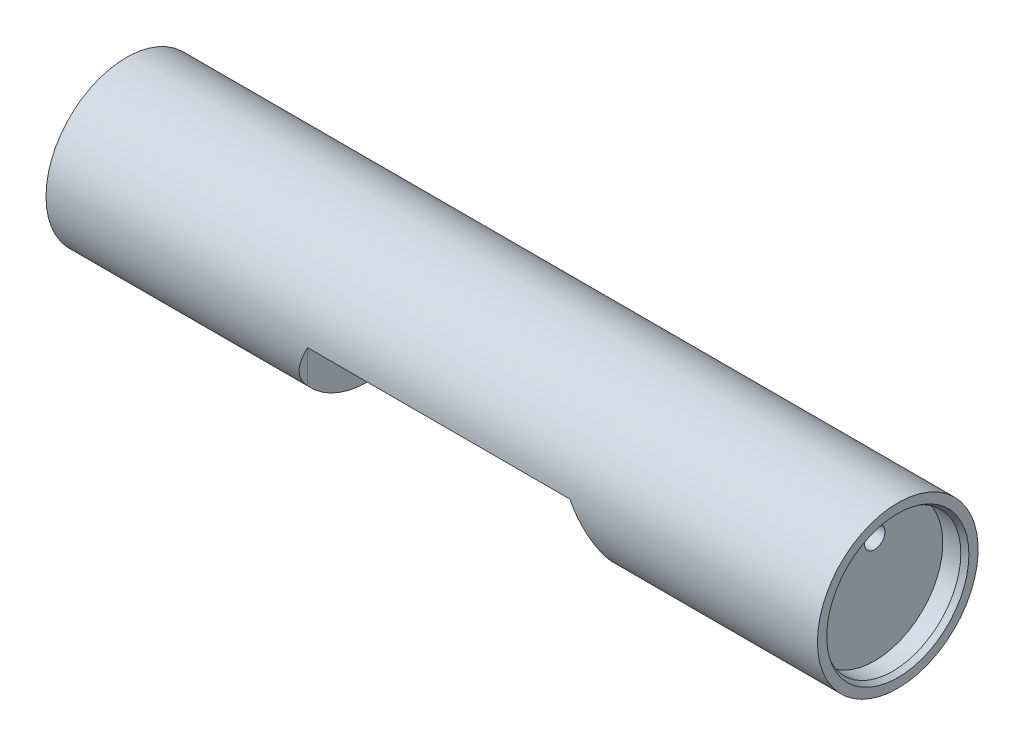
ISO-10303-21;
HEADER;
FILE_DESCRIPTION(('STEP AP214'),'2;1');
FILE_NAME('part.step','',(''),(''),'','','');
FILE_SCHEMA(('AUTOMOTIVE_DESIGN { 1 0 10303 214 1 1 1 1 }'));
ENDSEC;
DATA;
#1=APPLICATION_CONTEXT('core data for automotive mechanical design processes');
#2=APPLICATION_PROTOCOL_DEFINITION('international standard','automotive_design',2000,#1);
#3=PRODUCT_CONTEXT('',#1,'mechanical');
#4=PRODUCT('Part','Part','',(#3));
#5=PRODUCT_RELATED_PRODUCT_CATEGORY('part','',(#4));
#6=PRODUCT_DEFINITION_FORMATION('','',#4);
#7=PRODUCT_DEFINITION_CONTEXT('part definition',#1,'design');
#8=PRODUCT_DEFINITION('design','',#6,#7);
#9=PRODUCT_DEFINITION_SHAPE('','',#8);
#10=(LENGTH_UNIT() NAMED_UNIT(*) SI_UNIT(.MILLI.,.METRE.));
#11=(NAMED_UNIT(*) PLANE_ANGLE_UNIT() SI_UNIT($,.RADIAN.));
#12=(NAMED_UNIT(*) SI_UNIT($,.STERADIAN.) SOLID_ANGLE_UNIT());
#13=UNCERTAINTY_MEASURE_WITH_UNIT(LENGTH_MEASURE(1.E-05),#10,'distance_accuracy_value','');
#14=(GEOMETRIC_REPRESENTATION_CONTEXT(3) GLOBAL_UNCERTAINTY_ASSIGNED_CONTEXT((#13)) GLOBAL_UNIT_ASSIGNED_CONTEXT((#10,
#11,#12)) REPRESENTATION_CONTEXT('',''));
#15=CARTESIAN_POINT('',(0.,0.,0.));
#16=DIRECTION('',(0.,0.,1.));
#17=DIRECTION('',(1.,0.,0.));
#18=AXIS2_PLACEMENT_3D('',#15,#16,#17);
#19=CARTESIAN_POINT('',(46.85,0.,-20.));
#20=DIRECTION('',(0.,1.,0.));
#21=DIRECTION('',(0.,0.,1.));
#22=AXIS2_PLACEMENT_3D('',#19,#20,#21);
#23=PLANE('',#22);
#24=CARTESIAN_POINT('',(62.35,0.,0.));
#25=DIRECTION('',(0.,-1.,0.));
#26=DIRECTION('',(0.,0.,-1.));
#27=AXIS2_PLACEMENT_3D('',#24,#25,#26);
#28=CIRCLE('',#27,1.65);
#29=CARTESIAN_POINT('',(62.35,0.,-1.65));
#30=VERTEX_POINT('',#29);
#31=EDGE_CURVE('E186',#30,#30,#28,.T.);
#32=ORIENTED_EDGE('',*,*,#31,.F.);
#33=EDGE_LOOP('',(#32));
#34=FACE_BOUND('',#33,.T.);
#35=CARTESIAN_POINT('',(90.35,0.,0.));
#36=DIRECTION('',(0.,-1.,0.));
#37=DIRECTION('',(0.,0.,-1.));
#38=AXIS2_PLACEMENT_3D('',#35,#36,#37);
#39=CIRCLE('',#38,1.65);
#40=CARTESIAN_POINT('',(90.35,0.,-1.65));
#41=VERTEX_POINT('',#40);
#42=EDGE_CURVE('E192',#41,#41,#39,.T.);
#43=ORIENTED_EDGE('',*,*,#42,.F.);
#44=EDGE_LOOP('',(#43));
#45=FACE_BOUND('',#44,.T.);
#46=CARTESIAN_POINT('',(101.85,0.,-11.625));
#47=DIRECTION('',(0.,1.,0.));
#48=DIRECTION('',(0.,0.,-1.));
#49=AXIS2_PLACEMENT_3D('',#46,#47,#48);
#50=CIRCLE('',#49,4.);
#51=CARTESIAN_POINT('',(105.85,0.,-11.625));
#52=VERTEX_POINT('',#51);
#53=CARTESIAN_POINT('',(101.85,0.,-15.625));
#54=VERTEX_POINT('',#53);
#55=EDGE_CURVE('E109',#52,#54,#50,.T.);
#56=ORIENTED_EDGE('',*,*,#55,.F.);
#57=DIRECTION('',(0.,0.,1.));
#58=VECTOR('',#57,1.);
#59=CARTESIAN_POINT('',(105.85,0.,-20.));
#60=LINE('',#59,#58);
#61=CARTESIAN_POINT('',(105.85,0.,11.625));
#62=VERTEX_POINT('',#61);
#63=EDGE_CURVE('E100',#52,#62,#60,.T.);
#64=ORIENTED_EDGE('',*,*,#63,.T.);
#65=CARTESIAN_POINT('',(101.85,0.,11.625));
#66=DIRECTION('',(0.,1.,0.));
#67=DIRECTION('',(0.,0.,-1.));
#68=AXIS2_PLACEMENT_3D('',#65,#66,#67);
#69=CIRCLE('',#68,4.);
#70=CARTESIAN_POINT('',(101.85,0.,15.625));
#71=VERTEX_POINT('',#70);
#72=EDGE_CURVE('E165',#71,#62,#69,.T.);
#73=ORIENTED_EDGE('',*,*,#72,.F.);
#74=DIRECTION('',(-1.,0.,0.));
#75=VECTOR('',#74,1.);
#76=CARTESIAN_POINT('',(0.,0.,15.625));
#77=LINE('',#76,#75);
#78=CARTESIAN_POINT('',(50.85,0.,15.625));
#79=VERTEX_POINT('',#78);
#80=EDGE_CURVE('E212',#71,#79,#77,.T.);
#81=ORIENTED_EDGE('',*,*,#80,.T.);
#82=CARTESIAN_POINT('',(50.85,0.,11.625));
#83=DIRECTION('',(0.,1.,0.));
#84=DIRECTION('',(0.,0.,-1.));
#85=AXIS2_PLACEMENT_3D('',#82,#83,#84);
#86=CIRCLE('',#85,4.);
#87=CARTESIAN_POINT('',(46.85,0.,11.625));
#88=VERTEX_POINT('',#87);
#89=EDGE_CURVE('E162',#88,#79,#86,.T.);
#90=ORIENTED_EDGE('',*,*,#89,.F.);
#91=DIRECTION('',(0.,0.,1.));
#92=VECTOR('',#91,1.);
#93=CARTESIAN_POINT('',(46.85,0.,-20.));
#94=LINE('',#93,#92);
#95=CARTESIAN_POINT('',(46.85,0.,-11.625));
#96=VERTEX_POINT('',#95);
#97=EDGE_CURVE('E106',#96,#88,#94,.T.);
#98=ORIENTED_EDGE('',*,*,#97,.F.);
#99=CARTESIAN_POINT('',(50.85,0.,-11.625));
#100=DIRECTION('',(0.,1.,0.));
#101=DIRECTION('',(0.,0.,-1.));
#102=AXIS2_PLACEMENT_3D('',#99,#100,#101);
#103=CIRCLE('',#102,4.);
#104=CARTESIAN_POINT('',(50.85,0.,-15.625));
#105=VERTEX_POINT('',#104);
#106=EDGE_CURVE('E125',#105,#96,#103,.T.);
#107=ORIENTED_EDGE('',*,*,#106,.F.);
#108=DIRECTION('',(-1.,0.,0.));
#109=VECTOR('',#108,1.);
#110=CARTESIAN_POINT('',(0.,0.,-15.625));
#111=LINE('',#110,#109);
#112=EDGE_CURVE('E51',#105,#54,#111,.F.);
#113=ORIENTED_EDGE('',*,*,#112,.T.);
#114=EDGE_LOOP('',(#56,#64,#73,#81,#90,#98,#107,#113));
#115=FACE_BOUND('',#114,.T.);
#116=ADVANCED_FACE('F36',(#34,#45,#115),#23,.F.);
#117=CARTESIAN_POINT('',(105.85,0.,-20.));
#118=DIRECTION('',(1.,0.,0.));
#119=DIRECTION('',(0.,0.,-1.));
#120=AXIS2_PLACEMENT_3D('',#117,#118,#119);
#121=PLANE('',#120);
#122=DIRECTION('',(0.,1.,0.));
#123=VECTOR('',#122,1.);
#124=CARTESIAN_POINT('',(105.85,-15.626,-11.625));
#125=LINE('',#124,#123);
#126=CARTESIAN_POINT('',(105.85,-10.4403065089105,-11.625));
#127=VERTEX_POINT('',#126);
#128=EDGE_CURVE('E59',#127,#52,#125,.T.);
#129=ORIENTED_EDGE('',*,*,#128,.F.);
#130=CARTESIAN_POINT('',(105.85,0.,0.));
#131=DIRECTION('',(1.,0.,0.));
#132=DIRECTION('',(0.,0.,-1.));
#133=AXIS2_PLACEMENT_3D('',#130,#131,#132);
#134=CIRCLE('',#133,15.625);
#135=CARTESIAN_POINT('',(105.85,-10.4403065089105,11.625));
#136=VERTEX_POINT('',#135);
#137=EDGE_CURVE('E210',#127,#136,#134,.F.);
#138=ORIENTED_EDGE('',*,*,#137,.T.);
#139=DIRECTION('',(0.,1.,0.));
#140=VECTOR('',#139,1.);
#141=CARTESIAN_POINT('',(105.85,-15.626,11.625));
#142=LINE('',#141,#140);
#143=EDGE_CURVE('E103',#136,#62,#142,.T.);
#144=ORIENTED_EDGE('',*,*,#143,.T.);
#145=ORIENTED_EDGE('',*,*,#63,.F.);
#146=EDGE_LOOP('',(#129,#138,#144,#145));
#147=FACE_BOUND('',#146,.T.);
#148=ADVANCED_FACE('F101',(#147),#121,.F.);
#149=CARTESIAN_POINT('',(46.85,0.,-20.));
#150=DIRECTION('',(-1.,0.,0.));
#151=DIRECTION('',(0.,0.,1.));
#152=AXIS2_PLACEMENT_3D('',#149,#150,#151);
#153=PLANE('',#152);
#154=CARTESIAN_POINT('',(46.85,0.,0.));
#155=DIRECTION('',(-1.,0.,0.));
#156=DIRECTION('',(0.,0.,1.));
#157=AXIS2_PLACEMENT_3D('',#154,#155,#156);
#158=CIRCLE('',#157,15.625);
#159=CARTESIAN_POINT('',(46.85,-10.4403065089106,11.625));
#160=VERTEX_POINT('',#159);
#161=CARTESIAN_POINT('',(46.85,-10.4403065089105,-11.625));
#162=VERTEX_POINT('',#161);
#163=EDGE_CURVE('E215',#160,#162,#158,.F.);
#164=ORIENTED_EDGE('',*,*,#163,.T.);
#165=DIRECTION('',(0.,1.,0.));
#166=VECTOR('',#165,1.);
#167=CARTESIAN_POINT('',(46.85,-15.626,-11.625));
#168=LINE('',#167,#166);
#169=EDGE_CURVE('E129',#162,#96,#168,.T.);
#170=ORIENTED_EDGE('',*,*,#169,.T.);
#171=ORIENTED_EDGE('',*,*,#97,.T.);
#172=DIRECTION('',(0.,1.,0.));
#173=VECTOR('',#172,1.);
#174=CARTESIAN_POINT('',(46.85,-15.626,11.625));
#175=LINE('',#174,#173);
#176=EDGE_CURVE('E161',#160,#88,#175,.T.);
#177=ORIENTED_EDGE('',*,*,#176,.F.);
#178=EDGE_LOOP('',(#164,#170,#171,#177));
#179=FACE_BOUND('',#178,.T.);
#180=ADVANCED_FACE('F248',(#179),#153,.F.);
#181=CARTESIAN_POINT('',(150.,0.,0.));
#182=DIRECTION('',(1.,0.,0.));
#183=DIRECTION('',(0.,0.,-1.));
#184=AXIS2_PLACEMENT_3D('',#181,#182,#183);
#185=PLANE('',#184);
#186=CARTESIAN_POINT('',(150.,0.,0.));
#187=DIRECTION('',(1.,0.,0.));
#188=DIRECTION('',(0.,0.,-1.));
#189=AXIS2_PLACEMENT_3D('',#186,#187,#188);
#190=CIRCLE('',#189,13.8273502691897);
#191=CARTESIAN_POINT('',(150.,0.,-13.8273502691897));
#192=VERTEX_POINT('',#191);
#193=EDGE_CURVE('E44',#192,#192,#190,.F.);
#194=ORIENTED_EDGE('',*,*,#193,.T.);
#195=EDGE_LOOP('',(#194));
#196=FACE_BOUND('',#195,.T.);
#197=CARTESIAN_POINT('',(150.,0.,0.));
#198=DIRECTION('',(-1.,0.,0.));
#199=DIRECTION('',(0.,0.,1.));
#200=AXIS2_PLACEMENT_3D('',#197,#198,#199);
#201=CIRCLE('',#200,15.625);
#202=CARTESIAN_POINT('',(150.,0.,15.625));
#203=VERTEX_POINT('',#202);
#204=EDGE_CURVE('E197',#203,#203,#201,.T.);
#205=ORIENTED_EDGE('',*,*,#204,.F.);
#206=EDGE_LOOP('',(#205));
#207=FACE_BOUND('',#206,.T.);
#208=ADVANCED_FACE('F225',(#196,#207),#185,.T.);
#209=CARTESIAN_POINT('',(0.,0.,0.));
#210=DIRECTION('',(-1.,0.,0.));
#211=DIRECTION('',(0.,0.,1.));
#212=AXIS2_PLACEMENT_3D('',#209,#210,#211);
#213=CYLINDRICAL_SURFACE('',#212,13.25);
#214=CARTESIAN_POINT('',(149.,0.,0.));
#215=DIRECTION('',(1.,0.,0.));
#216=DIRECTION('',(0.,0.,-1.));
#217=AXIS2_PLACEMENT_3D('',#214,#215,#216);
#218=CIRCLE('',#217,13.25);
#219=CARTESIAN_POINT('',(149.,0.,-13.25));
#220=VERTEX_POINT('',#219);
#221=EDGE_CURVE('E11',#220,#220,#218,.T.);
#222=ORIENTED_EDGE('',*,*,#221,.T.);
#223=EDGE_LOOP('',(#222));
#224=FACE_BOUND('',#223,.T.);
#225=CARTESIAN_POINT('',(145.5,0.,0.));
#226=DIRECTION('',(-1.,0.,0.));
#227=DIRECTION('',(0.,0.,1.));
#228=AXIS2_PLACEMENT_3D('',#225,#226,#227);
#229=CIRCLE('',#228,13.25);
#230=CARTESIAN_POINT('',(145.5,0.,13.25));
#231=VERTEX_POINT('',#230);
#232=EDGE_CURVE('E204',#231,#231,#229,.T.);
#233=ORIENTED_EDGE('',*,*,#232,.T.);
#234=EDGE_LOOP('',(#233));
#235=FACE_BOUND('',#234,.T.);
#236=ADVANCED_FACE('F260',(#224,#235),#213,.F.);
#237=CARTESIAN_POINT('',(145.5,13.25,0.));
#238=DIRECTION('',(1.,0.,0.));
#239=DIRECTION('',(0.,0.,-1.));
#240=AXIS2_PLACEMENT_3D('',#237,#238,#239);
#241=PLANE('',#240);
#242=CARTESIAN_POINT('',(145.5,7.5,0.));
#243=DIRECTION('',(1.,0.,0.));
#244=DIRECTION('',(0.,0.,-1.));
#245=AXIS2_PLACEMENT_3D('',#242,#243,#244);
#246=CIRCLE('',#245,1.99999999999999);
#247=CARTESIAN_POINT('',(145.5,7.5,-1.99999999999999));
#248=VERTEX_POINT('',#247);
#249=EDGE_CURVE('E167',#248,#248,#246,.T.);
#250=ORIENTED_EDGE('',*,*,#249,.F.);
#251=EDGE_LOOP('',(#250));
#252=FACE_BOUND('',#251,.T.);
#253=ORIENTED_EDGE('',*,*,#232,.F.);
#254=EDGE_LOOP('',(#253));
#255=FACE_BOUND('',#254,.T.);
#256=ADVANCED_FACE('F327',(#252,#255),#241,.T.);
#257=CARTESIAN_POINT('',(0.,0.,0.));
#258=DIRECTION('',(-1.,0.,0.));
#259=DIRECTION('',(0.,0.,1.));
#260=AXIS2_PLACEMENT_3D('',#257,#258,#259);
#261=CYLINDRICAL_SURFACE('',#260,15.625);
#262=ORIENTED_EDGE('',*,*,#112,.F.);
#263=CARTESIAN_POINT('',(46.85,-10.4403065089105,-11.625));
#264=CARTESIAN_POINT('',(46.850004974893,-10.3453494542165,-11.7102828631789));
#265=CARTESIAN_POINT('',(46.852726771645,-10.249367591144,-11.7943782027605));
#266=CARTESIAN_POINT('',(46.8631914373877,-10.0555605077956,-11.9600402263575));
#267=CARTESIAN_POINT('',(46.8709327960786,-9.95773585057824,-12.0416076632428));
#268=CARTESIAN_POINT('',(46.9010294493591,-9.66212216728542,-12.2820368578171));
#269=CARTESIAN_POINT('',(46.9302607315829,-9.46180529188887,-12.4369738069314));
#270=CARTESIAN_POINT('',(47.0038916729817,-9.05751681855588,-12.73438317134));
#271=CARTESIAN_POINT('',(47.0481642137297,-8.85358900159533,-12.8769478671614));
#272=CARTESIAN_POINT('',(47.1495961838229,-8.44132324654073,-13.1508931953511));
#273=CARTESIAN_POINT('',(47.2067640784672,-8.23298249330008,-13.2822664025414));
#274=CARTESIAN_POINT('',(47.3662714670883,-7.69761325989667,-13.6026103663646));
#275=CARTESIAN_POINT('',(47.4761979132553,-7.3681053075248,-13.7836959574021));
#276=CARTESIAN_POINT('',(47.7160478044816,-6.70288384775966,-14.1191670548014));
#277=CARTESIAN_POINT('',(47.8459781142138,-6.36716824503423,-14.2735433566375));
#278=CARTESIAN_POINT('',(48.1218844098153,-5.68943022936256,-14.5570122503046));
#279=CARTESIAN_POINT('',(48.2679394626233,-5.34738426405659,-14.685970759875));
#280=CARTESIAN_POINT('',(48.5717433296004,-4.65996528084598,-14.9183440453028));
#281=CARTESIAN_POINT('',(48.7294903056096,-4.3145927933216,-15.0217628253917));
#282=CARTESIAN_POINT('',(49.0442398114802,-3.64146341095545,-15.1984970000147));
#283=CARTESIAN_POINT('',(49.2007565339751,-3.31384450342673,-15.2732087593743));
#284=CARTESIAN_POINT('',(49.5192404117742,-2.65712691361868,-15.4010475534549));
#285=CARTESIAN_POINT('',(49.6812079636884,-2.32802812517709,-15.4541730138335));
#286=CARTESIAN_POINT('',(50.1715182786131,-1.34103048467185,-15.581444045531));
#287=CARTESIAN_POINT('',(50.5052999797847,-0.681273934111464,-15.624043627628));
#288=CARTESIAN_POINT('',(50.8424756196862,-0.0148713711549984,-15.6249946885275));
#289=CARTESIAN_POINT('',(50.8462378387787,-0.00743563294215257,-15.6249999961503));
#290=CARTESIAN_POINT('',(50.85,0.,-15.625));
#291=B_SPLINE_CURVE_WITH_KNOTS('',3,(#263,#264,#265,#266,#267,#268,#269,#270,#271,#272,#273,
#274,#275,#276,#277,#278,#279,#280,#281,#282,#283,#284,#285,#286,#287,#288,#289,#290),
.UNSPECIFIED.,.F.,.F.,(4,2,2,2,2,2,2,2,2,2,2,2,2,4),(0.,0.382806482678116,0.765497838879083,
1.52932170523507,2.28684452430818,3.04486608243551,4.21825469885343,5.39204688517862,
6.57187434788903,7.75151671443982,8.86285251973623,9.97426936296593,12.1897788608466,
12.2147788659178),.UNSPECIFIED.);
#292=EDGE_CURVE('E113',#105,#162,#291,.F.);
#293=ORIENTED_EDGE('',*,*,#292,.T.);
#294=ORIENTED_EDGE('',*,*,#163,.F.);
#295=CARTESIAN_POINT('',(46.85,-10.4403065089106,11.625));
#296=CARTESIAN_POINT('',(46.850004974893,-10.3453494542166,11.7102828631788));
#297=CARTESIAN_POINT('',(46.852726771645,-10.2493675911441,11.7943782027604));
#298=CARTESIAN_POINT('',(46.8631914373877,-10.0555605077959,11.9600402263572));
#299=CARTESIAN_POINT('',(46.8709327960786,-9.9577358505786,12.0416076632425));
#300=CARTESIAN_POINT('',(46.901029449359,-9.66212216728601,12.2820368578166));
#301=CARTESIAN_POINT('',(46.9302607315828,-9.46180529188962,12.4369738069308));
#302=CARTESIAN_POINT('',(47.0038916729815,-9.05751681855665,12.7343831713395));
#303=CARTESIAN_POINT('',(47.0481642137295,-8.85358900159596,12.876947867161));
#304=CARTESIAN_POINT('',(47.1495961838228,-8.44132324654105,13.1508931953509));
#305=CARTESIAN_POINT('',(47.2067640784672,-8.23298249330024,13.2822664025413));
#306=CARTESIAN_POINT('',(47.3662714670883,-7.69761325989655,13.6026103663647));
#307=CARTESIAN_POINT('',(47.4761979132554,-7.36810530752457,13.7836959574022));
#308=CARTESIAN_POINT('',(47.7160478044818,-6.7028838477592,14.1191670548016));
#309=CARTESIAN_POINT('',(47.845978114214,-6.36716824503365,14.2735433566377));
#310=CARTESIAN_POINT('',(48.1218844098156,-5.68943022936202,14.5570122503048));
#311=CARTESIAN_POINT('',(48.2679394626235,-5.34738426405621,14.6859707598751));
#312=CARTESIAN_POINT('',(48.5717433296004,-4.65996528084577,14.9183440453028));
#313=CARTESIAN_POINT('',(48.7294903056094,-4.3145927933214,15.0217628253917));
#314=CARTESIAN_POINT('',(49.0442398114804,-3.64146341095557,15.1984970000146));
#315=CARTESIAN_POINT('',(49.2007565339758,-3.31384450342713,15.2732087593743));
#316=CARTESIAN_POINT('',(49.5192404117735,-2.6571269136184,15.4010475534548));
#317=CARTESIAN_POINT('',(49.6812079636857,-2.32802812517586,15.4541730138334));
#318=CARTESIAN_POINT('',(50.1715182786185,-1.34103048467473,15.581444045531));
#319=CARTESIAN_POINT('',(50.5052999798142,-0.681273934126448,15.624043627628));
#320=CARTESIAN_POINT('',(50.8424756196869,-0.0148713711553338,15.6249946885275));
#321=CARTESIAN_POINT('',(50.8462378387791,-0.00743563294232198,15.6249999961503));
#322=CARTESIAN_POINT('',(50.85,0.,15.625));
#323=B_SPLINE_CURVE_WITH_KNOTS('',3,(#295,#296,#297,#298,#299,#300,#301,#302,#303,#304,#305,
#306,#307,#308,#309,#310,#311,#312,#313,#314,#315,#316,#317,#318,#319,#320,#321,#322),
.UNSPECIFIED.,.F.,.F.,(4,2,2,2,2,2,2,2,2,2,2,2,2,4),(0.,0.382806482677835,0.765497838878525,
1.52932170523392,2.2868445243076,3.04486608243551,4.21825469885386,5.39204688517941,
6.57187434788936,7.75151671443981,8.86285251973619,9.97426936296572,12.1897788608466,
12.2147788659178),.UNSPECIFIED.);
#324=EDGE_CURVE('E128',#160,#79,#323,.T.);
#325=ORIENTED_EDGE('',*,*,#324,.T.);
#326=ORIENTED_EDGE('',*,*,#80,.F.);
#327=CARTESIAN_POINT('',(105.85,-10.4403065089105,11.625));
#328=CARTESIAN_POINT('',(105.849995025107,-10.3453494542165,11.7102828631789));
#329=CARTESIAN_POINT('',(105.847273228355,-10.249367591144,11.7943782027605));
#330=CARTESIAN_POINT('',(105.836808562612,-10.0555605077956,11.9600402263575));
#331=CARTESIAN_POINT('',(105.829067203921,-9.9577358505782,12.0416076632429));
#332=CARTESIAN_POINT('',(105.798970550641,-9.66212216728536,12.2820368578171));
#333=CARTESIAN_POINT('',(105.769739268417,-9.4618052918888,12.4369738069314));
#334=CARTESIAN_POINT('',(105.696108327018,-9.0575168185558,12.7343831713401));
#335=CARTESIAN_POINT('',(105.65183578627,-8.85358900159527,12.8769478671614));
#336=CARTESIAN_POINT('',(105.550403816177,-8.44132324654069,13.1508931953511));
#337=CARTESIAN_POINT('',(105.493235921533,-8.23298249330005,13.2822664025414));
#338=CARTESIAN_POINT('',(105.333728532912,-7.69761325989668,13.6026103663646));
#339=CARTESIAN_POINT('',(105.223802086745,-7.36810530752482,13.7836959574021));
#340=CARTESIAN_POINT('',(104.983952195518,-6.70288384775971,14.1191670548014));
#341=CARTESIAN_POINT('',(104.854021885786,-6.36716824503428,14.2735433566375));
#342=CARTESIAN_POINT('',(104.578115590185,-5.68943022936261,14.5570122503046));
#343=CARTESIAN_POINT('',(104.432060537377,-5.34738426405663,14.6859707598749));
#344=CARTESIAN_POINT('',(104.1282566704,-4.659965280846,14.9183440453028));
#345=CARTESIAN_POINT('',(103.97050969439,-4.31459279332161,15.0217628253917));
#346=CARTESIAN_POINT('',(103.65576018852,-3.64146341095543,15.1984970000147));
#347=CARTESIAN_POINT('',(103.499243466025,-3.3138445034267,15.2732087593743));
#348=CARTESIAN_POINT('',(103.180759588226,-2.65712691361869,15.4010475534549));
#349=CARTESIAN_POINT('',(103.018792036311,-2.32802812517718,15.4541730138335));
#350=CARTESIAN_POINT('',(102.528481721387,-1.34103048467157,15.581444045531));
#351=CARTESIAN_POINT('',(102.194700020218,-0.681273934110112,15.624043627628));
#352=CARTESIAN_POINT('',(101.857524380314,-0.0148713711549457,15.6249946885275));
#353=CARTESIAN_POINT('',(101.853762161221,-0.00743563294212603,15.6249999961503));
#354=CARTESIAN_POINT('',(101.85,0.,15.625));
#355=B_SPLINE_CURVE_WITH_KNOTS('',3,(#327,#328,#329,#330,#331,#332,#333,#334,#335,#336,#337,
#338,#339,#340,#341,#342,#343,#344,#345,#346,#347,#348,#349,#350,#351,#352,#353,#354),
.UNSPECIFIED.,.F.,.F.,(4,2,2,2,2,2,2,2,2,2,2,2,2,4),(0.,0.38280648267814,0.765497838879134,
1.52932170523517,2.28684452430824,3.04486608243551,4.21825469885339,5.39204688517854,
6.571874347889,7.75151671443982,8.86285251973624,9.97426936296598,12.1897788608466,
12.2147788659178),.UNSPECIFIED.);
#356=EDGE_CURVE('E168',#71,#136,#355,.F.);
#357=ORIENTED_EDGE('',*,*,#356,.T.);
#358=ORIENTED_EDGE('',*,*,#137,.F.);
#359=CARTESIAN_POINT('',(105.85,-10.4403065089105,-11.625));
#360=CARTESIAN_POINT('',(105.849995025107,-10.3453494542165,-11.7102828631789));
#361=CARTESIAN_POINT('',(105.847273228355,-10.249367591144,-11.7943782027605));
#362=CARTESIAN_POINT('',(105.836808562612,-10.0555605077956,-11.9600402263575));
#363=CARTESIAN_POINT('',(105.829067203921,-9.9577358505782,-12.0416076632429));
#364=CARTESIAN_POINT('',(105.798970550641,-9.66212216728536,-12.2820368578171));
#365=CARTESIAN_POINT('',(105.769739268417,-9.4618052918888,-12.4369738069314));
#366=CARTESIAN_POINT('',(105.696108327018,-9.0575168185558,-12.7343831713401));
#367=CARTESIAN_POINT('',(105.65183578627,-8.85358900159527,-12.8769478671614));
#368=CARTESIAN_POINT('',(105.550403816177,-8.44132324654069,-13.1508931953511));
#369=CARTESIAN_POINT('',(105.493235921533,-8.23298249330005,-13.2822664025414));
#370=CARTESIAN_POINT('',(105.333728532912,-7.69761325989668,-13.6026103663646));
#371=CARTESIAN_POINT('',(105.223802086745,-7.36810530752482,-13.7836959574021));
#372=CARTESIAN_POINT('',(104.983952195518,-6.70288384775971,-14.1191670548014));
#373=CARTESIAN_POINT('',(104.854021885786,-6.36716824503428,-14.2735433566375));
#374=CARTESIAN_POINT('',(104.578115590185,-5.68943022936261,-14.5570122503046));
#375=CARTESIAN_POINT('',(104.432060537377,-5.34738426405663,-14.6859707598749));
#376=CARTESIAN_POINT('',(104.1282566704,-4.659965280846,-14.9183440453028));
#377=CARTESIAN_POINT('',(103.97050969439,-4.31459279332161,-15.0217628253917));
#378=CARTESIAN_POINT('',(103.65576018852,-3.64146341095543,-15.1984970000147));
#379=CARTESIAN_POINT('',(103.499243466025,-3.3138445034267,-15.2732087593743));
#380=CARTESIAN_POINT('',(103.180759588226,-2.65712691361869,-15.4010475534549));
#381=CARTESIAN_POINT('',(103.018792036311,-2.32802812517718,-15.4541730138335));
#382=CARTESIAN_POINT('',(102.528481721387,-1.34103048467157,-15.581444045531));
#383=CARTESIAN_POINT('',(102.194700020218,-0.681273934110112,-15.624043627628));
#384=CARTESIAN_POINT('',(101.857524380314,-0.0148713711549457,-15.6249946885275));
#385=CARTESIAN_POINT('',(101.853762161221,-0.00743563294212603,-15.6249999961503));
#386=CARTESIAN_POINT('',(101.85,0.,-15.625));
#387=B_SPLINE_CURVE_WITH_KNOTS('',3,(#359,#360,#361,#362,#363,#364,#365,#366,#367,#368,#369,
#370,#371,#372,#373,#374,#375,#376,#377,#378,#379,#380,#381,#382,#383,#384,#385,#386),
.UNSPECIFIED.,.F.,.F.,(4,2,2,2,2,2,2,2,2,2,2,2,2,4),(0.,0.38280648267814,0.765497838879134,
1.52932170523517,2.28684452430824,3.04486608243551,4.21825469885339,5.39204688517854,
6.571874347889,7.75151671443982,8.86285251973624,9.97426936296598,12.1897788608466,
12.2147788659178),.UNSPECIFIED.);
#388=EDGE_CURVE('E116',#127,#54,#387,.T.);
#389=ORIENTED_EDGE('',*,*,#388,.T.);
#390=EDGE_LOOP('',(#262,#293,#294,#325,#326,#357,#358,#389));
#391=FACE_BOUND('',#390,.T.);
#392=ORIENTED_EDGE('',*,*,#204,.T.);
#393=EDGE_LOOP('',(#392));
#394=FACE_BOUND('',#393,.T.);
#395=CARTESIAN_POINT('',(0.,0.,0.));
#396=DIRECTION('',(-1.,0.,0.));
#397=DIRECTION('',(0.,0.,1.));
#398=AXIS2_PLACEMENT_3D('',#395,#396,#397);
#399=CIRCLE('',#398,15.625);
#400=CARTESIAN_POINT('',(0.,0.,15.625));
#401=VERTEX_POINT('',#400);
#402=EDGE_CURVE('E201',#401,#401,#399,.T.);
#403=ORIENTED_EDGE('',*,*,#402,.F.);
#404=EDGE_LOOP('',(#403));
#405=FACE_BOUND('',#404,.T.);
#406=ADVANCED_FACE('F137',(#391,#394,#405),#261,.T.);
#407=CARTESIAN_POINT('',(5.5,13.25,0.));
#408=DIRECTION('',(-1.,0.,0.));
#409=DIRECTION('',(0.,0.,1.));
#410=AXIS2_PLACEMENT_3D('',#407,#408,#409);
#411=PLANE('',#410);
#412=CARTESIAN_POINT('',(5.5,7.5,0.));
#413=DIRECTION('',(-1.,0.,0.));
#414=DIRECTION('',(0.,0.,1.));
#415=AXIS2_PLACEMENT_3D('',#412,#413,#414);
#416=CIRCLE('',#415,2.);
#417=CARTESIAN_POINT('',(5.5,7.5,2.));
#418=VERTEX_POINT('',#417);
#419=EDGE_CURVE('E180',#418,#418,#416,.T.);
#420=ORIENTED_EDGE('',*,*,#419,.F.);
#421=EDGE_LOOP('',(#420));
#422=FACE_BOUND('',#421,.T.);
#423=CARTESIAN_POINT('',(5.5,0.,0.));
#424=DIRECTION('',(-1.,0.,0.));
#425=DIRECTION('',(0.,0.,1.));
#426=AXIS2_PLACEMENT_3D('',#423,#424,#425);
#427=CIRCLE('',#426,13.25);
#428=CARTESIAN_POINT('',(5.5,0.,13.25));
#429=VERTEX_POINT('',#428);
#430=EDGE_CURVE('E207',#429,#429,#427,.T.);
#431=ORIENTED_EDGE('',*,*,#430,.T.);
#432=EDGE_LOOP('',(#431));
#433=FACE_BOUND('',#432,.T.);
#434=ADVANCED_FACE('F318',(#422,#433),#411,.T.);
#435=CARTESIAN_POINT('',(0.,0.,0.));
#436=DIRECTION('',(-1.,0.,0.));
#437=DIRECTION('',(0.,0.,1.));
#438=AXIS2_PLACEMENT_3D('',#435,#436,#437);
#439=CYLINDRICAL_SURFACE('',#438,13.25);
#440=CARTESIAN_POINT('',(1.00000000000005,0.,0.));
#441=DIRECTION('',(1.,0.,0.));
#442=DIRECTION('',(0.,0.,-1.));
#443=AXIS2_PLACEMENT_3D('',#440,#441,#442);
#444=CIRCLE('',#443,13.25);
#445=CARTESIAN_POINT('',(1.00000000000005,0.,-13.25));
#446=VERTEX_POINT('',#445);
#447=EDGE_CURVE('E217',#446,#446,#444,.F.);
#448=ORIENTED_EDGE('',*,*,#447,.T.);
#449=EDGE_LOOP('',(#448));
#450=FACE_BOUND('',#449,.T.);
#451=ORIENTED_EDGE('',*,*,#430,.F.);
#452=EDGE_LOOP('',(#451));
#453=FACE_BOUND('',#452,.T.);
#454=ADVANCED_FACE('F312',(#450,#453),#439,.F.);
#455=CARTESIAN_POINT('',(0.,0.,0.));
#456=DIRECTION('',(1.,0.,0.));
#457=DIRECTION('',(0.,0.,-1.));
#458=AXIS2_PLACEMENT_3D('',#455,#456,#457);
#459=PLANE('',#458);
#460=CARTESIAN_POINT('',(0.,0.,0.));
#461=DIRECTION('',(1.,0.,0.));
#462=DIRECTION('',(0.,0.,-1.));
#463=AXIS2_PLACEMENT_3D('',#460,#461,#462);
#464=CIRCLE('',#463,13.8273502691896);
#465=CARTESIAN_POINT('',(0.,0.,-13.8273502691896));
#466=VERTEX_POINT('',#465);
#467=EDGE_CURVE('E220',#466,#466,#464,.T.);
#468=ORIENTED_EDGE('',*,*,#467,.T.);
#469=EDGE_LOOP('',(#468));
#470=FACE_BOUND('',#469,.T.);
#471=ORIENTED_EDGE('',*,*,#402,.T.);
#472=EDGE_LOOP('',(#471));
#473=FACE_BOUND('',#472,.T.);
#474=ADVANCED_FACE('F303',(#470,#473),#459,.F.);
#475=CARTESIAN_POINT('',(90.35,11.5,0.));
#476=DIRECTION('',(0.,-1.,0.));
#477=DIRECTION('',(0.,0.,-1.));
#478=AXIS2_PLACEMENT_3D('',#475,#476,#477);
#479=CONICAL_SURFACE('',#478,1.65,1.02974425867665);
#480=CARTESIAN_POINT('',(90.35,12.4914200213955,0.));
#481=VERTEX_POINT('',#480);
#482=VERTEX_LOOP('',#481);
#483=FACE_BOUND('',#482,.T.);
#484=CARTESIAN_POINT('',(90.35,11.5,0.));
#485=DIRECTION('',(0.,-1.,0.));
#486=DIRECTION('',(0.,0.,-1.));
#487=AXIS2_PLACEMENT_3D('',#484,#485,#486);
#488=CIRCLE('',#487,1.65);
#489=CARTESIAN_POINT('',(90.35,11.5,-1.65));
#490=VERTEX_POINT('',#489);
#491=EDGE_CURVE('E107',#490,#490,#488,.T.);
#492=ORIENTED_EDGE('',*,*,#491,.T.);
#493=EDGE_LOOP('',(#492));
#494=FACE_BOUND('',#493,.T.);
#495=ADVANCED_FACE('F253',(#483,#494),#479,.F.);
#496=CARTESIAN_POINT('',(90.35,0.,0.));
#497=DIRECTION('',(0.,-1.,0.));
#498=DIRECTION('',(0.,0.,-1.));
#499=AXIS2_PLACEMENT_3D('',#496,#497,#498);
#500=CYLINDRICAL_SURFACE('',#499,1.65);
#501=ORIENTED_EDGE('',*,*,#491,.F.);
#502=EDGE_LOOP('',(#501));
#503=FACE_BOUND('',#502,.T.);
#504=ORIENTED_EDGE('',*,*,#42,.T.);
#505=EDGE_LOOP('',(#504));
#506=FACE_BOUND('',#505,.T.);
#507=ADVANCED_FACE('F296',(#503,#506),#500,.F.);
#508=CARTESIAN_POINT('',(62.35,11.5,0.));
#509=DIRECTION('',(0.,-1.,0.));
#510=DIRECTION('',(0.,0.,-1.));
#511=AXIS2_PLACEMENT_3D('',#508,#509,#510);
#512=CONICAL_SURFACE('',#511,1.65,1.02974425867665);
#513=CARTESIAN_POINT('',(62.35,12.4914200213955,0.));
#514=VERTEX_POINT('',#513);
#515=VERTEX_LOOP('',#514);
#516=FACE_BOUND('',#515,.T.);
#517=CARTESIAN_POINT('',(62.35,11.5,0.));
#518=DIRECTION('',(0.,-1.,0.));
#519=DIRECTION('',(0.,0.,-1.));
#520=AXIS2_PLACEMENT_3D('',#517,#518,#519);
#521=CIRCLE('',#520,1.65);
#522=CARTESIAN_POINT('',(62.35,11.5,-1.65));
#523=VERTEX_POINT('',#522);
#524=EDGE_CURVE('E189',#523,#523,#521,.T.);
#525=ORIENTED_EDGE('',*,*,#524,.T.);
#526=EDGE_LOOP('',(#525));
#527=FACE_BOUND('',#526,.T.);
#528=ADVANCED_FACE('F293',(#516,#527),#512,.F.);
#529=CARTESIAN_POINT('',(62.35,0.,0.));
#530=DIRECTION('',(0.,-1.,0.));
#531=DIRECTION('',(0.,0.,-1.));
#532=AXIS2_PLACEMENT_3D('',#529,#530,#531);
#533=CYLINDRICAL_SURFACE('',#532,1.65);
#534=ORIENTED_EDGE('',*,*,#524,.F.);
#535=EDGE_LOOP('',(#534));
#536=FACE_BOUND('',#535,.T.);
#537=ORIENTED_EDGE('',*,*,#31,.T.);
#538=EDGE_LOOP('',(#537));
#539=FACE_BOUND('',#538,.T.);
#540=ADVANCED_FACE('F239',(#536,#539),#533,.F.);
#541=CARTESIAN_POINT('',(1.00000000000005,0.,0.));
#542=DIRECTION('',(-1.,0.,0.));
#543=DIRECTION('',(0.,0.,1.));
#544=AXIS2_PLACEMENT_3D('',#541,#542,#543);
#545=CONICAL_SURFACE('',#544,13.25,0.523598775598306);
#546=ORIENTED_EDGE('',*,*,#467,.F.);
#547=EDGE_LOOP('',(#546));
#548=FACE_BOUND('',#547,.T.);
#549=ORIENTED_EDGE('',*,*,#447,.F.);
#550=EDGE_LOOP('',(#549));
#551=FACE_BOUND('',#550,.T.);
#552=ADVANCED_FACE('F230',(#548,#551),#545,.F.);
#553=CARTESIAN_POINT('',(150.,0.,0.));
#554=DIRECTION('',(1.,0.,0.));
#555=DIRECTION('',(0.,0.,-1.));
#556=AXIS2_PLACEMENT_3D('',#553,#554,#555);
#557=CONICAL_SURFACE('',#556,13.8273502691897,0.52359877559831);
#558=ORIENTED_EDGE('',*,*,#221,.F.);
#559=EDGE_LOOP('',(#558));
#560=FACE_BOUND('',#559,.T.);
#561=ORIENTED_EDGE('',*,*,#193,.F.);
#562=EDGE_LOOP('',(#561));
#563=FACE_BOUND('',#562,.T.);
#564=ADVANCED_FACE('F38',(#560,#563),#557,.F.);
#565=CARTESIAN_POINT('',(15.5,7.5,0.));
#566=DIRECTION('',(-1.,0.,0.));
#567=DIRECTION('',(0.,0.,1.));
#568=AXIS2_PLACEMENT_3D('',#565,#566,#567);
#569=CONICAL_SURFACE('',#568,2.,1.02974425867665);
#570=CARTESIAN_POINT('',(16.7017212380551,7.5,0.));
#571=VERTEX_POINT('',#570);
#572=VERTEX_LOOP('',#571);
#573=FACE_BOUND('',#572,.T.);
#574=CARTESIAN_POINT('',(15.5,7.5,0.));
#575=DIRECTION('',(-1.,0.,0.));
#576=DIRECTION('',(0.,0.,1.));
#577=AXIS2_PLACEMENT_3D('',#574,#575,#576);
#578=CIRCLE('',#577,2.);
#579=CARTESIAN_POINT('',(15.5,7.5,2.));
#580=VERTEX_POINT('',#579);
#581=EDGE_CURVE('E183',#580,#580,#578,.T.);
#582=ORIENTED_EDGE('',*,*,#581,.T.);
#583=EDGE_LOOP('',(#582));
#584=FACE_BOUND('',#583,.T.);
#585=ADVANCED_FACE('F229',(#573,#584),#569,.F.);
#586=CARTESIAN_POINT('',(5.5,7.5,0.));
#587=DIRECTION('',(-1.,0.,0.));
#588=DIRECTION('',(0.,0.,1.));
#589=AXIS2_PLACEMENT_3D('',#586,#587,#588);
#590=CYLINDRICAL_SURFACE('',#589,2.);
#591=ORIENTED_EDGE('',*,*,#581,.F.);
#592=EDGE_LOOP('',(#591));
#593=FACE_BOUND('',#592,.T.);
#594=ORIENTED_EDGE('',*,*,#419,.T.);
#595=EDGE_LOOP('',(#594));
#596=FACE_BOUND('',#595,.T.);
#597=ADVANCED_FACE('F236',(#593,#596),#590,.F.);
#598=CARTESIAN_POINT('',(135.5,7.5,0.));
#599=DIRECTION('',(1.,0.,0.));
#600=DIRECTION('',(0.,0.,-1.));
#601=AXIS2_PLACEMENT_3D('',#598,#599,#600);
#602=CONICAL_SURFACE('',#601,1.99999999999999,1.02974425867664);
#603=CARTESIAN_POINT('',(134.298278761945,7.49999999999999,0.));
#604=VERTEX_POINT('',#603);
#605=VERTEX_LOOP('',#604);
#606=FACE_BOUND('',#605,.T.);
#607=CARTESIAN_POINT('',(135.5,7.5,0.));
#608=DIRECTION('',(1.,0.,0.));
#609=DIRECTION('',(0.,0.,-1.));
#610=AXIS2_PLACEMENT_3D('',#607,#608,#609);
#611=CIRCLE('',#610,1.99999999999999);
#612=CARTESIAN_POINT('',(135.5,7.5,-1.99999999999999));
#613=VERTEX_POINT('',#612);
#614=EDGE_CURVE('E177',#613,#613,#611,.T.);
#615=ORIENTED_EDGE('',*,*,#614,.T.);
#616=EDGE_LOOP('',(#615));
#617=FACE_BOUND('',#616,.T.);
#618=ADVANCED_FACE('F278',(#606,#617),#602,.F.);
#619=CARTESIAN_POINT('',(145.5,7.5,0.));
#620=DIRECTION('',(1.,0.,0.));
#621=DIRECTION('',(0.,0.,-1.));
#622=AXIS2_PLACEMENT_3D('',#619,#620,#621);
#623=CYLINDRICAL_SURFACE('',#622,1.99999999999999);
#624=ORIENTED_EDGE('',*,*,#614,.F.);
#625=EDGE_LOOP('',(#624));
#626=FACE_BOUND('',#625,.T.);
#627=ORIENTED_EDGE('',*,*,#249,.T.);
#628=EDGE_LOOP('',(#627));
#629=FACE_BOUND('',#628,.T.);
#630=ADVANCED_FACE('F274',(#626,#629),#623,.F.);
#631=CARTESIAN_POINT('',(101.85,-15.626,11.625));
#632=DIRECTION('',(0.,1.,0.));
#633=DIRECTION('',(0.,0.,1.));
#634=AXIS2_PLACEMENT_3D('',#631,#632,#633);
#635=CYLINDRICAL_SURFACE('',#634,4.);
#636=ORIENTED_EDGE('',*,*,#356,.F.);
#637=ORIENTED_EDGE('',*,*,#72,.T.);
#638=ORIENTED_EDGE('',*,*,#143,.F.);
#639=EDGE_LOOP('',(#636,#637,#638));
#640=FACE_BOUND('',#639,.T.);
#641=ADVANCED_FACE('F151',(#640),#635,.F.);
#642=CARTESIAN_POINT('',(50.85,-15.626,11.625));
#643=DIRECTION('',(0.,1.,0.));
#644=DIRECTION('',(0.,0.,1.));
#645=AXIS2_PLACEMENT_3D('',#642,#643,#644);
#646=CYLINDRICAL_SURFACE('',#645,4.);
#647=ORIENTED_EDGE('',*,*,#324,.F.);
#648=ORIENTED_EDGE('',*,*,#176,.T.);
#649=ORIENTED_EDGE('',*,*,#89,.T.);
#650=EDGE_LOOP('',(#647,#648,#649));
#651=FACE_BOUND('',#650,.T.);
#652=ADVANCED_FACE('F145',(#651),#646,.F.);
#653=CARTESIAN_POINT('',(50.85,-15.626,-11.625));
#654=DIRECTION('',(0.,1.,0.));
#655=DIRECTION('',(0.,0.,1.));
#656=AXIS2_PLACEMENT_3D('',#653,#654,#655);
#657=CYLINDRICAL_SURFACE('',#656,4.);
#658=ORIENTED_EDGE('',*,*,#292,.F.);
#659=ORIENTED_EDGE('',*,*,#106,.T.);
#660=ORIENTED_EDGE('',*,*,#169,.F.);
#661=EDGE_LOOP('',(#658,#659,#660));
#662=FACE_BOUND('',#661,.T.);
#663=ADVANCED_FACE('F141',(#662),#657,.F.);
#664=CARTESIAN_POINT('',(101.85,-15.626,-11.625));
#665=DIRECTION('',(0.,1.,0.));
#666=DIRECTION('',(0.,0.,1.));
#667=AXIS2_PLACEMENT_3D('',#664,#665,#666);
#668=CYLINDRICAL_SURFACE('',#667,4.);
#669=ORIENTED_EDGE('',*,*,#388,.F.);
#670=ORIENTED_EDGE('',*,*,#128,.T.);
#671=ORIENTED_EDGE('',*,*,#55,.T.);
#672=EDGE_LOOP('',(#669,#670,#671));
#673=FACE_BOUND('',#672,.T.);
#674=ADVANCED_FACE('F115',(#673),#668,.F.);
#675=CLOSED_SHELL('',(#116,#148,#180,#208,#236,#256,#406,#434,#454,#474,#495,#507,#528,#540,
#552,#564,#585,#597,#618,#630,#641,#652,#663,#674));
#676=MANIFOLD_SOLID_BREP('B2',#675);
#677=ADVANCED_BREP_SHAPE_REPRESENTATION('',(#18,#676),#14);
#678=SHAPE_DEFINITION_REPRESENTATION(#9,#677);
ENDSEC;
END-ISO-10303-21;
